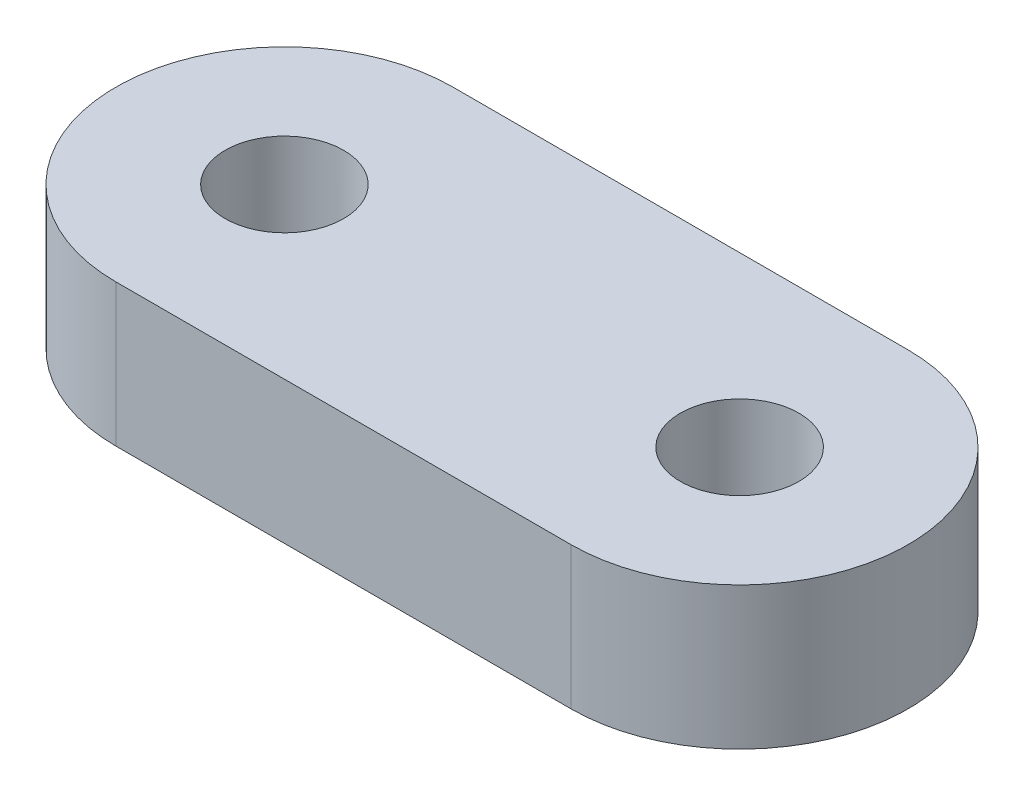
ISO-10303-21;
HEADER;
FILE_DESCRIPTION(('STEP AP214'),'2;1');
FILE_NAME('part.step','',(''),(''),'','','');
FILE_SCHEMA(('AUTOMOTIVE_DESIGN { 1 0 10303 214 1 1 1 1 }'));
ENDSEC;
DATA;
#1=APPLICATION_CONTEXT('core data for automotive mechanical design processes');
#2=APPLICATION_PROTOCOL_DEFINITION('international standard','automotive_design',2000,#1);
#3=PRODUCT_CONTEXT('',#1,'mechanical');
#4=PRODUCT('Part','Part','',(#3));
#5=PRODUCT_RELATED_PRODUCT_CATEGORY('part','',(#4));
#6=PRODUCT_DEFINITION_FORMATION('','',#4);
#7=PRODUCT_DEFINITION_CONTEXT('part definition',#1,'design');
#8=PRODUCT_DEFINITION('design','',#6,#7);
#9=PRODUCT_DEFINITION_SHAPE('','',#8);
#10=(LENGTH_UNIT() NAMED_UNIT(*) SI_UNIT(.MILLI.,.METRE.));
#11=(NAMED_UNIT(*) PLANE_ANGLE_UNIT() SI_UNIT($,.RADIAN.));
#12=(NAMED_UNIT(*) SI_UNIT($,.STERADIAN.) SOLID_ANGLE_UNIT());
#13=UNCERTAINTY_MEASURE_WITH_UNIT(LENGTH_MEASURE(1.E-05),#10,'distance_accuracy_value','');
#14=(GEOMETRIC_REPRESENTATION_CONTEXT(3) GLOBAL_UNCERTAINTY_ASSIGNED_CONTEXT((#13)) GLOBAL_UNIT_ASSIGNED_CONTEXT((#10,
#11,#12)) REPRESENTATION_CONTEXT('',''));
#15=CARTESIAN_POINT('',(0.,0.,0.));
#16=DIRECTION('',(0.,0.,1.));
#17=DIRECTION('',(1.,0.,0.));
#18=AXIS2_PLACEMENT_3D('',#15,#16,#17);
#19=CARTESIAN_POINT('',(19.2024000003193,3.00000000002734,0.));
#20=DIRECTION('',(0.,-1.,0.));
#21=DIRECTION('',(-0.783291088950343,0.,-0.621655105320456));
#22=AXIS2_PLACEMENT_3D('',#19,#20,#21);
#23=CYLINDRICAL_SURFACE('',#22,2.5);
#24=CARTESIAN_POINT('',(19.2024000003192,3.00000000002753,0.));
#25=DIRECTION('',(0.,1.,0.));
#26=DIRECTION('',(0.940919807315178,0.,-0.338629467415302));
#27=AXIS2_PLACEMENT_3D('',#24,#25,#26);
#28=CIRCLE('',#27,2.5);
#29=CARTESIAN_POINT('',(21.5546995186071,3.00000000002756,-0.846573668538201));
#30=VERTEX_POINT('',#29);
#31=EDGE_CURVE('E172',#30,#30,#28,.F.);
#32=ORIENTED_EDGE('',*,*,#31,.F.);
#33=EDGE_LOOP('',(#32));
#34=FACE_BOUND('',#33,.T.);
#35=CARTESIAN_POINT('',(19.2024000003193,-2.99999999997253,0.));
#36=DIRECTION('',(0.,-1.,0.));
#37=DIRECTION('',(-0.338629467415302,0.,-0.940919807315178));
#38=AXIS2_PLACEMENT_3D('',#35,#36,#37);
#39=CIRCLE('',#38,2.5);
#40=CARTESIAN_POINT('',(18.355826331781,-2.99999999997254,-2.35229951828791));
#41=VERTEX_POINT('',#40);
#42=EDGE_CURVE('E175',#41,#41,#39,.T.);
#43=ORIENTED_EDGE('',*,*,#42,.T.);
#44=EDGE_LOOP('',(#43));
#45=FACE_BOUND('',#44,.T.);
#46=ADVANCED_FACE('F14',(#34,#45),#23,.F.);
#47=CARTESIAN_POINT('',(0.,2.99999999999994,0.));
#48=DIRECTION('',(0.,-1.,0.));
#49=DIRECTION('',(0.971257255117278,0.,-0.238032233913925));
#50=AXIS2_PLACEMENT_3D('',#47,#48,#49);
#51=CYLINDRICAL_SURFACE('',#50,2.5);
#52=CARTESIAN_POINT('',(0.,3.00000000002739,0.));
#53=DIRECTION('',(0.,1.,0.));
#54=DIRECTION('',(0.940919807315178,0.,-0.338629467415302));
#55=AXIS2_PLACEMENT_3D('',#52,#53,#54);
#56=CIRCLE('',#55,2.5);
#57=CARTESIAN_POINT('',(2.35229951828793,3.00000000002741,-0.846573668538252));
#58=VERTEX_POINT('',#57);
#59=EDGE_CURVE('E75',#58,#58,#56,.F.);
#60=ORIENTED_EDGE('',*,*,#59,.F.);
#61=EDGE_LOOP('',(#60));
#62=FACE_BOUND('',#61,.T.);
#63=CARTESIAN_POINT('',(0.,-2.99999999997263,0.));
#64=DIRECTION('',(0.,-1.,0.));
#65=DIRECTION('',(-0.338629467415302,0.,-0.940919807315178));
#66=AXIS2_PLACEMENT_3D('',#63,#64,#65);
#67=CIRCLE('',#66,2.5);
#68=CARTESIAN_POINT('',(-0.846573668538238,-2.99999999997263,-2.35229951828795));
#69=VERTEX_POINT('',#68);
#70=EDGE_CURVE('E78',#69,#69,#67,.T.);
#71=ORIENTED_EDGE('',*,*,#70,.T.);
#72=EDGE_LOOP('',(#71));
#73=FACE_BOUND('',#72,.T.);
#74=ADVANCED_FACE('F107',(#62,#73),#51,.F.);
#75=CARTESIAN_POINT('',(19.2024000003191,3.00000000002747,7.11200000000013));
#76=DIRECTION('',(0.,0.,-1.));
#77=DIRECTION('',(0.,1.,0.));
#78=AXIS2_PLACEMENT_3D('',#75,#76,#77);
#79=PLANE('',#78);
#80=DIRECTION('',(0.,-1.,0.));
#81=VECTOR('',#80,1.);
#82=CARTESIAN_POINT('',(19.2024000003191,3.00000000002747,7.11200000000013));
#83=LINE('',#82,#81);
#84=CARTESIAN_POINT('',(19.2024000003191,3.00000000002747,7.11200000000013));
#85=VERTEX_POINT('',#84);
#86=CARTESIAN_POINT('',(19.2024000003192,-2.99999999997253,7.11200000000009));
#87=VERTEX_POINT('',#86);
#88=EDGE_CURVE('E72',#85,#87,#83,.T.);
#89=ORIENTED_EDGE('',*,*,#88,.F.);
#90=DIRECTION('',(1.,0.,0.));
#91=VECTOR('',#90,1.);
#92=CARTESIAN_POINT('',(19.2024000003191,3.00000000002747,7.11200000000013));
#93=LINE('',#92,#91);
#94=CARTESIAN_POINT('',(-1.49186218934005E-13,3.00000000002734,7.11200000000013));
#95=VERTEX_POINT('',#94);
#96=EDGE_CURVE('E61',#95,#85,#93,.T.);
#97=ORIENTED_EDGE('',*,*,#96,.F.);
#98=DIRECTION('',(0.,1.,0.));
#99=VECTOR('',#98,1.);
#100=CARTESIAN_POINT('',(-1.49186218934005E-13,3.00000000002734,7.11200000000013));
#101=LINE('',#100,#99);
#102=CARTESIAN_POINT('',(-1.11022302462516E-13,-2.99999999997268,7.11200000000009));
#103=VERTEX_POINT('',#102);
#104=EDGE_CURVE('E71',#103,#95,#101,.T.);
#105=ORIENTED_EDGE('',*,*,#104,.F.);
#106=DIRECTION('',(1.,0.,0.));
#107=VECTOR('',#106,1.);
#108=CARTESIAN_POINT('',(-1.11022302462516E-13,-2.99999999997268,7.11200000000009));
#109=LINE('',#108,#107);
#110=EDGE_CURVE('E87',#103,#87,#109,.T.);
#111=ORIENTED_EDGE('',*,*,#110,.T.);
#112=EDGE_LOOP('',(#89,#97,#105,#111));
#113=FACE_BOUND('',#112,.T.);
#114=ADVANCED_FACE('F16',(#113),#79,.F.);
#115=CARTESIAN_POINT('',(-1.45716771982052E-13,3.00000000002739,1.05818132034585E-13));
#116=DIRECTION('',(0.,-1.,0.));
#117=DIRECTION('',(-1.,0.,0.));
#118=AXIS2_PLACEMENT_3D('',#115,#116,#117);
#119=CYLINDRICAL_SURFACE('',#118,7.112);
#120=DIRECTION('',(0.,-1.,0.));
#121=VECTOR('',#120,1.);
#122=CARTESIAN_POINT('',(-1.45716771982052E-13,3.00000000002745,-7.11199999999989));
#123=LINE('',#122,#121);
#124=CARTESIAN_POINT('',(-1.42247325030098E-13,3.00000000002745,-7.11199999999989));
#125=VERTEX_POINT('',#124);
#126=CARTESIAN_POINT('',(-1.04083408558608E-13,-2.99999999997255,-7.112));
#127=VERTEX_POINT('',#126);
#128=EDGE_CURVE('E68',#125,#127,#123,.T.);
#129=ORIENTED_EDGE('',*,*,#128,.T.);
#130=CARTESIAN_POINT('',(-1.05818132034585E-13,-2.99999999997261,0.));
#131=DIRECTION('',(0.,-1.,0.));
#132=DIRECTION('',(-1.,0.,0.));
#133=AXIS2_PLACEMENT_3D('',#130,#131,#132);
#134=CIRCLE('',#133,7.112);
#135=EDGE_CURVE('E33',#127,#103,#134,.F.);
#136=ORIENTED_EDGE('',*,*,#135,.T.);
#137=ORIENTED_EDGE('',*,*,#104,.T.);
#138=CARTESIAN_POINT('',(-1.45716771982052E-13,3.00000000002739,1.05818132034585E-13));
#139=DIRECTION('',(0.,-1.,0.));
#140=DIRECTION('',(-1.,0.,0.));
#141=AXIS2_PLACEMENT_3D('',#138,#139,#140);
#142=CIRCLE('',#141,7.112);
#143=EDGE_CURVE('E57',#95,#125,#142,.T.);
#144=ORIENTED_EDGE('',*,*,#143,.T.);
#145=EDGE_LOOP('',(#129,#136,#137,#144));
#146=FACE_BOUND('',#145,.T.);
#147=ADVANCED_FACE('F74',(#146),#119,.T.);
#148=CARTESIAN_POINT('',(-1.42247325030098E-13,3.00000000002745,-7.11199999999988));
#149=DIRECTION('',(0.,0.,1.));
#150=DIRECTION('',(0.,-1.,0.));
#151=AXIS2_PLACEMENT_3D('',#148,#149,#150);
#152=PLANE('',#151);
#153=ORIENTED_EDGE('',*,*,#128,.F.);
#154=DIRECTION('',(1.,0.,0.));
#155=VECTOR('',#154,1.);
#156=CARTESIAN_POINT('',(-1.42247325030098E-13,3.00000000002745,-7.11199999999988));
#157=LINE('',#156,#155);
#158=CARTESIAN_POINT('',(19.2024000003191,3.0000000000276,-7.11199999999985));
#159=VERTEX_POINT('',#158);
#160=EDGE_CURVE('E64',#159,#125,#157,.F.);
#161=ORIENTED_EDGE('',*,*,#160,.F.);
#162=DIRECTION('',(0.,-1.,0.));
#163=VECTOR('',#162,1.);
#164=CARTESIAN_POINT('',(19.2024000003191,3.0000000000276,-7.11199999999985));
#165=LINE('',#164,#163);
#166=CARTESIAN_POINT('',(19.2024000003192,-2.9999999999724,-7.11199999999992));
#167=VERTEX_POINT('',#166);
#168=EDGE_CURVE('E83',#167,#159,#165,.F.);
#169=ORIENTED_EDGE('',*,*,#168,.F.);
#170=DIRECTION('',(1.,0.,0.));
#171=VECTOR('',#170,1.);
#172=CARTESIAN_POINT('',(-1.02348685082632E-13,-2.99999999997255,-7.11199999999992));
#173=LINE('',#172,#171);
#174=EDGE_CURVE('E9',#167,#127,#173,.F.);
#175=ORIENTED_EDGE('',*,*,#174,.T.);
#176=EDGE_LOOP('',(#153,#161,#169,#175));
#177=FACE_BOUND('',#176,.T.);
#178=ADVANCED_FACE('F95',(#177),#152,.F.);
#179=CARTESIAN_POINT('',(0.,-3.00000000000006,0.));
#180=DIRECTION('',(0.,1.,0.));
#181=DIRECTION('',(-0.971257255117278,0.,0.238032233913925));
#182=AXIS2_PLACEMENT_3D('',#179,#180,#181);
#183=PLANE('',#182);
#184=ORIENTED_EDGE('',*,*,#174,.F.);
#185=CARTESIAN_POINT('',(19.2024000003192,-2.99999999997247,0.));
#186=DIRECTION('',(0.,-1.,0.));
#187=DIRECTION('',(-1.,0.,0.));
#188=AXIS2_PLACEMENT_3D('',#185,#186,#187);
#189=CIRCLE('',#188,7.112);
#190=EDGE_CURVE('E24',#87,#167,#189,.F.);
#191=ORIENTED_EDGE('',*,*,#190,.F.);
#192=ORIENTED_EDGE('',*,*,#110,.F.);
#193=ORIENTED_EDGE('',*,*,#135,.F.);
#194=EDGE_LOOP('',(#184,#191,#192,#193));
#195=FACE_BOUND('',#194,.T.);
#196=ORIENTED_EDGE('',*,*,#70,.F.);
#197=EDGE_LOOP('',(#196));
#198=FACE_BOUND('',#197,.T.);
#199=ORIENTED_EDGE('',*,*,#42,.F.);
#200=EDGE_LOOP('',(#199));
#201=FACE_BOUND('',#200,.T.);
#202=ADVANCED_FACE('F92',(#195,#198,#201),#183,.F.);
#203=CARTESIAN_POINT('',(19.2024000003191,3.00000000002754,1.07986536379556E-13));
#204=DIRECTION('',(0.,-1.,0.));
#205=DIRECTION('',(-1.,0.,0.));
#206=AXIS2_PLACEMENT_3D('',#203,#204,#205);
#207=CYLINDRICAL_SURFACE('',#206,7.112);
#208=CARTESIAN_POINT('',(19.2024000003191,3.00000000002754,1.07986536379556E-13));
#209=DIRECTION('',(0.,-1.,0.));
#210=DIRECTION('',(-1.,0.,0.));
#211=AXIS2_PLACEMENT_3D('',#208,#209,#210);
#212=CIRCLE('',#211,7.112);
#213=EDGE_CURVE('E18',#159,#85,#212,.T.);
#214=ORIENTED_EDGE('',*,*,#213,.T.);
#215=ORIENTED_EDGE('',*,*,#88,.T.);
#216=ORIENTED_EDGE('',*,*,#190,.T.);
#217=ORIENTED_EDGE('',*,*,#168,.T.);
#218=EDGE_LOOP('',(#214,#215,#216,#217));
#219=FACE_BOUND('',#218,.T.);
#220=ADVANCED_FACE('F91',(#219),#207,.T.);
#221=CARTESIAN_POINT('',(0.,2.99999999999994,0.));
#222=DIRECTION('',(0.,1.,0.));
#223=DIRECTION('',(-0.971257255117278,0.,0.238032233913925));
#224=AXIS2_PLACEMENT_3D('',#221,#222,#223);
#225=PLANE('',#224);
#226=ORIENTED_EDGE('',*,*,#213,.F.);
#227=ORIENTED_EDGE('',*,*,#160,.T.);
#228=ORIENTED_EDGE('',*,*,#143,.F.);
#229=ORIENTED_EDGE('',*,*,#96,.T.);
#230=EDGE_LOOP('',(#226,#227,#228,#229));
#231=FACE_BOUND('',#230,.T.);
#232=ORIENTED_EDGE('',*,*,#59,.T.);
#233=EDGE_LOOP('',(#232));
#234=FACE_BOUND('',#233,.T.);
#235=ORIENTED_EDGE('',*,*,#31,.T.);
#236=EDGE_LOOP('',(#235));
#237=FACE_BOUND('',#236,.T.);
#238=ADVANCED_FACE('F59',(#231,#234,#237),#225,.T.);
#239=CLOSED_SHELL('',(#46,#74,#114,#147,#178,#202,#220,#238));
#240=MANIFOLD_SOLID_BREP('B1',#239);
#241=ADVANCED_BREP_SHAPE_REPRESENTATION('',(#18,#240),#14);
#242=SHAPE_DEFINITION_REPRESENTATION(#9,#241);
ENDSEC;
END-ISO-10303-21;
